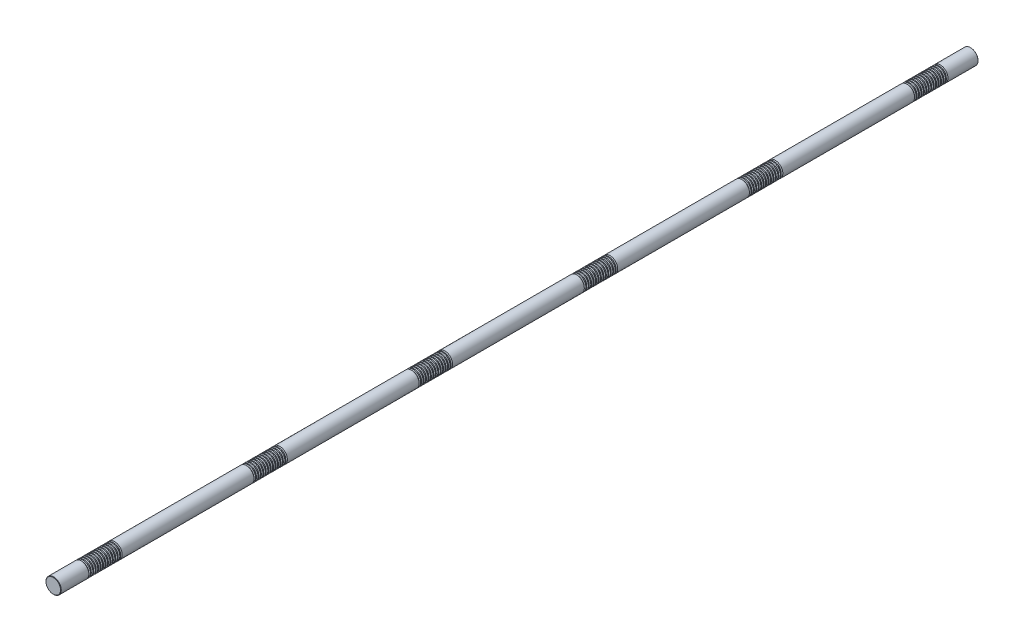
from build123d import *

# Parameters (mm, degrees)
SKETCH1_R           = 25
BOSS_EXTRUDE1_DEPTH = 1500
CHAMFER1_SIZE       = 1.25
LPATTERN1_COUNT     = 14
LPATTERN1_PITCH     = 8
LPATTERN2_COUNT     = 6
LPATTERN2_PITCH     = 540


with BuildPart() as part:
    # Sketch1 → Boss-Extrude1 (new, symmetric)
    with BuildSketch(Plane.XY):
        Circle(SKETCH1_R)
    extrude(amount=BOSS_EXTRUDE1_DEPTH, both=True)

    # Chamfer1
    chamfer1_edges = [part.edges().sort_by_distance(p)[0] for p in [
        (-25, 0, -1500),
        (-25, 0, 1500),
    ]]
    chamfer(chamfer1_edges, length=CHAMFER1_SIZE)

    # Sketch2 → Cut-Revolve1 (revolve, cut)
    with BuildSketch(Plane(origin=(0, 0, 0), x_dir=(0, 0, -1), z_dir=(1, 0, 0)), mode=Mode.PRIVATE) as cut_revolve1_sk:
        Polygon((1400.602885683, 25), (1395.397114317, 25), (1396.602885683, 20.5), (1399.397114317, 20.5), align=None)
    cut_revolve1 = revolve(cut_revolve1_sk.sketch.rotate(Axis((0, 0, 1500), (0, 0, -1)), 90), axis=Axis((0, 0, 1500), (0, 0, -1)), mode=Mode.SUBTRACT)

    # LPattern1: Cut-Revolve1 ×14
    with Locations(*[(0, 0, i * LPATTERN1_PITCH) for i in range(1, LPATTERN1_COUNT)]):
        add(cut_revolve1, mode=Mode.SUBTRACT)

    # LPattern2: Cut-Revolve1 ×6
    with Locations(*[(0, 0, i * LPATTERN2_PITCH) for i in range(1, LPATTERN2_COUNT)]):
        add(cut_revolve1, mode=Mode.SUBTRACT)

    # LPattern2 copy 1 sketch → LPattern2 copy 1 (revolve, cut)
    with BuildSketch(Plane(origin=(0, 0, 548), x_dir=(0, 0, -1), z_dir=(1, 0, 0))):
        Polygon((1400.602885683, 25), (1395.397114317, 25), (1396.602885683, 20.5), (1399.397114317, 20.5), align=None)
    revolve(axis=Axis((0, 0, 2048), (0, 0, -1)), mode=Mode.SUBTRACT)

    # LPattern2 copy 2 sketch → LPattern2 copy 2 (revolve, cut)
    with BuildSketch(Plane(origin=(0, 0, 1088), x_dir=(0, 0, -1), z_dir=(1, 0, 0))):
        Polygon((1400.602885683, 25), (1395.397114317, 25), (1396.602885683, 20.5), (1399.397114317, 20.5), align=None)
    revolve(axis=Axis((0, 0, 2588), (0, 0, -1)), mode=Mode.SUBTRACT)

    # LPattern2 copy 3 sketch → LPattern2 copy 3 (revolve, cut)
    with BuildSketch(Plane(origin=(0, 0, 1628), x_dir=(0, 0, -1), z_dir=(1, 0, 0))):
        Polygon((1400.602885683, 25), (1395.397114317, 25), (1396.602885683, 20.5), (1399.397114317, 20.5), align=None)
    revolve(axis=Axis((0, 0, 3128), (0, 0, -1)), mode=Mode.SUBTRACT)

    # LPattern2 copy 4 sketch → LPattern2 copy 4 (revolve, cut)
    with BuildSketch(Plane(origin=(0, 0, 2168), x_dir=(0, 0, -1), z_dir=(1, 0, 0))):
        Polygon((1400.602885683, 25), (1395.397114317, 25), (1396.602885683, 20.5), (1399.397114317, 20.5), align=None)
    revolve(axis=Axis((0, 0, 3668), (0, 0, -1)), mode=Mode.SUBTRACT)

    # LPattern2 copy 5 sketch → LPattern2 copy 5 (revolve, cut)
    with BuildSketch(Plane(origin=(0, 0, 2708), x_dir=(0, 0, -1), z_dir=(1, 0, 0))):
        Polygon((1400.602885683, 25), (1395.397114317, 25), (1396.602885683, 20.5), (1399.397114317, 20.5), align=None)
    revolve(axis=Axis((0, 0, 4208), (0, 0, -1)), mode=Mode.SUBTRACT)

    # LPattern2 copy 6 sketch → LPattern2 copy 6 (revolve, cut)
    with BuildSketch(Plane(origin=(0, 0, 556), x_dir=(0, 0, -1), z_dir=(1, 0, 0))):
        Polygon((1400.602885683, 25), (1395.397114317, 25), (1396.602885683, 20.5), (1399.397114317, 20.5), align=None)
    revolve(axis=Axis((0, 0, 2056), (0, 0, -1)), mode=Mode.SUBTRACT)

    # LPattern2 copy 7 sketch → LPattern2 copy 7 (revolve, cut)
    with BuildSketch(Plane(origin=(0, 0, 1096), x_dir=(0, 0, -1), z_dir=(1, 0, 0))):
        Polygon((1400.602885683, 25), (1395.397114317, 25), (1396.602885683, 20.5), (1399.397114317, 20.5), align=None)
    revolve(axis=Axis((0, 0, 2596), (0, 0, -1)), mode=Mode.SUBTRACT)

    # LPattern2 copy 8 sketch → LPattern2 copy 8 (revolve, cut)
    with BuildSketch(Plane(origin=(0, 0, 1636), x_dir=(0, 0, -1), z_dir=(1, 0, 0))):
        Polygon((1400.602885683, 25), (1395.397114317, 25), (1396.602885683, 20.5), (1399.397114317, 20.5), align=None)
    revolve(axis=Axis((0, 0, 3136), (0, 0, -1)), mode=Mode.SUBTRACT)

    # LPattern2 copy 9 sketch → LPattern2 copy 9 (revolve, cut)
    with BuildSketch(Plane(origin=(0, 0, 2176), x_dir=(0, 0, -1), z_dir=(1, 0, 0))):
        Polygon((1400.602885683, 25), (1395.397114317, 25), (1396.602885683, 20.5), (1399.397114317, 20.5), align=None)
    revolve(axis=Axis((0, 0, 3676), (0, 0, -1)), mode=Mode.SUBTRACT)

    # LPattern2 copy 10 sketch → LPattern2 copy 10 (revolve, cut)
    with BuildSketch(Plane(origin=(0, 0, 2716), x_dir=(0, 0, -1), z_dir=(1, 0, 0))):
        Polygon((1400.602885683, 25), (1395.397114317, 25), (1396.602885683, 20.5), (1399.397114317, 20.5), align=None)
    revolve(axis=Axis((0, 0, 4216), (0, 0, -1)), mode=Mode.SUBTRACT)

    # LPattern2 copy 11 sketch → LPattern2 copy 11 (revolve, cut)
    with BuildSketch(Plane(origin=(0, 0, 564), x_dir=(0, 0, -1), z_dir=(1, 0, 0))):
        Polygon((1400.602885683, 25), (1395.397114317, 25), (1396.602885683, 20.5), (1399.397114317, 20.5), align=None)
    revolve(axis=Axis((0, 0, 2064), (0, 0, -1)), mode=Mode.SUBTRACT)

    # LPattern2 copy 12 sketch → LPattern2 copy 12 (revolve, cut)
    with BuildSketch(Plane(origin=(0, 0, 1104), x_dir=(0, 0, -1), z_dir=(1, 0, 0))):
        Polygon((1400.602885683, 25), (1395.397114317, 25), (1396.602885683, 20.5), (1399.397114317, 20.5), align=None)
    revolve(axis=Axis((0, 0, 2604), (0, 0, -1)), mode=Mode.SUBTRACT)

    # LPattern2 copy 13 sketch → LPattern2 copy 13 (revolve, cut)
    with BuildSketch(Plane(origin=(0, 0, 1644), x_dir=(0, 0, -1), z_dir=(1, 0, 0))):
        Polygon((1400.602885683, 25), (1395.397114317, 25), (1396.602885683, 20.5), (1399.397114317, 20.5), align=None)
    revolve(axis=Axis((0, 0, 3144), (0, 0, -1)), mode=Mode.SUBTRACT)

    # LPattern2 copy 14 sketch → LPattern2 copy 14 (revolve, cut)
    with BuildSketch(Plane(origin=(0, 0, 2184), x_dir=(0, 0, -1), z_dir=(1, 0, 0))):
        Polygon((1400.602885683, 25), (1395.397114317, 25), (1396.602885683, 20.5), (1399.397114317, 20.5), align=None)
    revolve(axis=Axis((0, 0, 3684), (0, 0, -1)), mode=Mode.SUBTRACT)

    # LPattern2 copy 15 sketch → LPattern2 copy 15 (revolve, cut)
    with BuildSketch(Plane(origin=(0, 0, 2724), x_dir=(0, 0, -1), z_dir=(1, 0, 0))):
        Polygon((1400.602885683, 25), (1395.397114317, 25), (1396.602885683, 20.5), (1399.397114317, 20.5), align=None)
    revolve(axis=Axis((0, 0, 4224), (0, 0, -1)), mode=Mode.SUBTRACT)

    # LPattern2 copy 16 sketch → LPattern2 copy 16 (revolve, cut)
    with BuildSketch(Plane(origin=(0, 0, 572), x_dir=(0, 0, -1), z_dir=(1, 0, 0))):
        Polygon((1400.602885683, 25), (1395.397114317, 25), (1396.602885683, 20.5), (1399.397114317, 20.5), align=None)
    revolve(axis=Axis((0, 0, 2072), (0, 0, -1)), mode=Mode.SUBTRACT)

    # LPattern2 copy 17 sketch → LPattern2 copy 17 (revolve, cut)
    with BuildSketch(Plane(origin=(0, 0, 1112), x_dir=(0, 0, -1), z_dir=(1, 0, 0))):
        Polygon((1400.602885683, 25), (1395.397114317, 25), (1396.602885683, 20.5), (1399.397114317, 20.5), align=None)
    revolve(axis=Axis((0, 0, 2612), (0, 0, -1)), mode=Mode.SUBTRACT)

    # LPattern2 copy 18 sketch → LPattern2 copy 18 (revolve, cut)
    with BuildSketch(Plane(origin=(0, 0, 1652), x_dir=(0, 0, -1), z_dir=(1, 0, 0))):
        Polygon((1400.602885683, 25), (1395.397114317, 25), (1396.602885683, 20.5), (1399.397114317, 20.5), align=None)
    revolve(axis=Axis((0, 0, 3152), (0, 0, -1)), mode=Mode.SUBTRACT)

    # LPattern2 copy 19 sketch → LPattern2 copy 19 (revolve, cut)
    with BuildSketch(Plane(origin=(0, 0, 2192), x_dir=(0, 0, -1), z_dir=(1, 0, 0))):
        Polygon((1400.602885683, 25), (1395.397114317, 25), (1396.602885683, 20.5), (1399.397114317, 20.5), align=None)
    revolve(axis=Axis((0, 0, 3692), (0, 0, -1)), mode=Mode.SUBTRACT)

    # LPattern2 copy 20 sketch → LPattern2 copy 20 (revolve, cut)
    with BuildSketch(Plane(origin=(0, 0, 2732), x_dir=(0, 0, -1), z_dir=(1, 0, 0))):
        Polygon((1400.602885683, 25), (1395.397114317, 25), (1396.602885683, 20.5), (1399.397114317, 20.5), align=None)
    revolve(axis=Axis((0, 0, 4232), (0, 0, -1)), mode=Mode.SUBTRACT)

    # LPattern2 copy 21 sketch → LPattern2 copy 21 (revolve, cut)
    with BuildSketch(Plane(origin=(0, 0, 580), x_dir=(0, 0, -1), z_dir=(1, 0, 0))):
        Polygon((1400.602885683, 25), (1395.397114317, 25), (1396.602885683, 20.5), (1399.397114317, 20.5), align=None)
    revolve(axis=Axis((0, 0, 2080), (0, 0, -1)), mode=Mode.SUBTRACT)

    # LPattern2 copy 22 sketch → LPattern2 copy 22 (revolve, cut)
    with BuildSketch(Plane(origin=(0, 0, 1120), x_dir=(0, 0, -1), z_dir=(1, 0, 0))):
        Polygon((1400.602885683, 25), (1395.397114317, 25), (1396.602885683, 20.5), (1399.397114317, 20.5), align=None)
    revolve(axis=Axis((0, 0, 2620), (0, 0, -1)), mode=Mode.SUBTRACT)

    # LPattern2 copy 23 sketch → LPattern2 copy 23 (revolve, cut)
    with BuildSketch(Plane(origin=(0, 0, 1660), x_dir=(0, 0, -1), z_dir=(1, 0, 0))):
        Polygon((1400.602885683, 25), (1395.397114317, 25), (1396.602885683, 20.5), (1399.397114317, 20.5), align=None)
    revolve(axis=Axis((0, 0, 3160), (0, 0, -1)), mode=Mode.SUBTRACT)

    # LPattern2 copy 24 sketch → LPattern2 copy 24 (revolve, cut)
    with BuildSketch(Plane(origin=(0, 0, 2200), x_dir=(0, 0, -1), z_dir=(1, 0, 0))):
        Polygon((1400.602885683, 25), (1395.397114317, 25), (1396.602885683, 20.5), (1399.397114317, 20.5), align=None)
    revolve(axis=Axis((0, 0, 3700), (0, 0, -1)), mode=Mode.SUBTRACT)

    # LPattern2 copy 25 sketch → LPattern2 copy 25 (revolve, cut)
    with BuildSketch(Plane(origin=(0, 0, 2740), x_dir=(0, 0, -1), z_dir=(1, 0, 0))):
        Polygon((1400.602885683, 25), (1395.397114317, 25), (1396.602885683, 20.5), (1399.397114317, 20.5), align=None)
    revolve(axis=Axis((0, 0, 4240), (0, 0, -1)), mode=Mode.SUBTRACT)

    # LPattern2 copy 26 sketch → LPattern2 copy 26 (revolve, cut)
    with BuildSketch(Plane(origin=(0, 0, 588), x_dir=(0, 0, -1), z_dir=(1, 0, 0))):
        Polygon((1400.602885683, 25), (1395.397114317, 25), (1396.602885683, 20.5), (1399.397114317, 20.5), align=None)
    revolve(axis=Axis((0, 0, 2088), (0, 0, -1)), mode=Mode.SUBTRACT)

    # LPattern2 copy 27 sketch → LPattern2 copy 27 (revolve, cut)
    with BuildSketch(Plane(origin=(0, 0, 1128), x_dir=(0, 0, -1), z_dir=(1, 0, 0))):
        Polygon((1400.602885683, 25), (1395.397114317, 25), (1396.602885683, 20.5), (1399.397114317, 20.5), align=None)
    revolve(axis=Axis((0, 0, 2628), (0, 0, -1)), mode=Mode.SUBTRACT)

    # LPattern2 copy 28 sketch → LPattern2 copy 28 (revolve, cut)
    with BuildSketch(Plane(origin=(0, 0, 1668), x_dir=(0, 0, -1), z_dir=(1, 0, 0))):
        Polygon((1400.602885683, 25), (1395.397114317, 25), (1396.602885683, 20.5), (1399.397114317, 20.5), align=None)
    revolve(axis=Axis((0, 0, 3168), (0, 0, -1)), mode=Mode.SUBTRACT)

    # LPattern2 copy 29 sketch → LPattern2 copy 29 (revolve, cut)
    with BuildSketch(Plane(origin=(0, 0, 2208), x_dir=(0, 0, -1), z_dir=(1, 0, 0))):
        Polygon((1400.602885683, 25), (1395.397114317, 25), (1396.602885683, 20.5), (1399.397114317, 20.5), align=None)
    revolve(axis=Axis((0, 0, 3708), (0, 0, -1)), mode=Mode.SUBTRACT)

    # LPattern2 copy 30 sketch → LPattern2 copy 30 (revolve, cut)
    with BuildSketch(Plane(origin=(0, 0, 2748), x_dir=(0, 0, -1), z_dir=(1, 0, 0))):
        Polygon((1400.602885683, 25), (1395.397114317, 25), (1396.602885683, 20.5), (1399.397114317, 20.5), align=None)
    revolve(axis=Axis((0, 0, 4248), (0, 0, -1)), mode=Mode.SUBTRACT)

    # LPattern2 copy 31 sketch → LPattern2 copy 31 (revolve, cut)
    with BuildSketch(Plane(origin=(0, 0, 596), x_dir=(0, 0, -1), z_dir=(1, 0, 0))):
        Polygon((1400.602885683, 25), (1395.397114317, 25), (1396.602885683, 20.5), (1399.397114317, 20.5), align=None)
    revolve(axis=Axis((0, 0, 2096), (0, 0, -1)), mode=Mode.SUBTRACT)

    # LPattern2 copy 32 sketch → LPattern2 copy 32 (revolve, cut)
    with BuildSketch(Plane(origin=(0, 0, 1136), x_dir=(0, 0, -1), z_dir=(1, 0, 0))):
        Polygon((1400.602885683, 25), (1395.397114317, 25), (1396.602885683, 20.5), (1399.397114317, 20.5), align=None)
    revolve(axis=Axis((0, 0, 2636), (0, 0, -1)), mode=Mode.SUBTRACT)

    # LPattern2 copy 33 sketch → LPattern2 copy 33 (revolve, cut)
    with BuildSketch(Plane(origin=(0, 0, 1676), x_dir=(0, 0, -1), z_dir=(1, 0, 0))):
        Polygon((1400.602885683, 25), (1395.397114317, 25), (1396.602885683, 20.5), (1399.397114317, 20.5), align=None)
    revolve(axis=Axis((0, 0, 3176), (0, 0, -1)), mode=Mode.SUBTRACT)

    # LPattern2 copy 34 sketch → LPattern2 copy 34 (revolve, cut)
    with BuildSketch(Plane(origin=(0, 0, 2216), x_dir=(0, 0, -1), z_dir=(1, 0, 0))):
        Polygon((1400.602885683, 25), (1395.397114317, 25), (1396.602885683, 20.5), (1399.397114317, 20.5), align=None)
    revolve(axis=Axis((0, 0, 3716), (0, 0, -1)), mode=Mode.SUBTRACT)

    # LPattern2 copy 35 sketch → LPattern2 copy 35 (revolve, cut)
    with BuildSketch(Plane(origin=(0, 0, 2756), x_dir=(0, 0, -1), z_dir=(1, 0, 0))):
        Polygon((1400.602885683, 25), (1395.397114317, 25), (1396.602885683, 20.5), (1399.397114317, 20.5), align=None)
    revolve(axis=Axis((0, 0, 4256), (0, 0, -1)), mode=Mode.SUBTRACT)

    # LPattern2 copy 36 sketch → LPattern2 copy 36 (revolve, cut)
    with BuildSketch(Plane(origin=(0, 0, 604), x_dir=(0, 0, -1), z_dir=(1, 0, 0))):
        Polygon((1400.602885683, 25), (1395.397114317, 25), (1396.602885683, 20.5), (1399.397114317, 20.5), align=None)
    revolve(axis=Axis((0, 0, 2104), (0, 0, -1)), mode=Mode.SUBTRACT)

    # LPattern2 copy 37 sketch → LPattern2 copy 37 (revolve, cut)
    with BuildSketch(Plane(origin=(0, 0, 1144), x_dir=(0, 0, -1), z_dir=(1, 0, 0))):
        Polygon((1400.602885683, 25), (1395.397114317, 25), (1396.602885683, 20.5), (1399.397114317, 20.5), align=None)
    revolve(axis=Axis((0, 0, 2644), (0, 0, -1)), mode=Mode.SUBTRACT)

    # LPattern2 copy 38 sketch → LPattern2 copy 38 (revolve, cut)
    with BuildSketch(Plane(origin=(0, 0, 1684), x_dir=(0, 0, -1), z_dir=(1, 0, 0))):
        Polygon((1400.602885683, 25), (1395.397114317, 25), (1396.602885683, 20.5), (1399.397114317, 20.5), align=None)
    revolve(axis=Axis((0, 0, 3184), (0, 0, -1)), mode=Mode.SUBTRACT)

    # LPattern2 copy 39 sketch → LPattern2 copy 39 (revolve, cut)
    with BuildSketch(Plane(origin=(0, 0, 2224), x_dir=(0, 0, -1), z_dir=(1, 0, 0))):
        Polygon((1400.602885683, 25), (1395.397114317, 25), (1396.602885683, 20.5), (1399.397114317, 20.5), align=None)
    revolve(axis=Axis((0, 0, 3724), (0, 0, -1)), mode=Mode.SUBTRACT)

    # LPattern2 copy 40 sketch → LPattern2 copy 40 (revolve, cut)
    with BuildSketch(Plane(origin=(0, 0, 2764), x_dir=(0, 0, -1), z_dir=(1, 0, 0))):
        Polygon((1400.602885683, 25), (1395.397114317, 25), (1396.602885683, 20.5), (1399.397114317, 20.5), align=None)
    revolve(axis=Axis((0, 0, 4264), (0, 0, -1)), mode=Mode.SUBTRACT)

    # LPattern2 copy 41 sketch → LPattern2 copy 41 (revolve, cut)
    with BuildSketch(Plane(origin=(0, 0, 612), x_dir=(0, 0, -1), z_dir=(1, 0, 0))):
        Polygon((1400.602885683, 25), (1395.397114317, 25), (1396.602885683, 20.5), (1399.397114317, 20.5), align=None)
    revolve(axis=Axis((0, 0, 2112), (0, 0, -1)), mode=Mode.SUBTRACT)

    # LPattern2 copy 42 sketch → LPattern2 copy 42 (revolve, cut)
    with BuildSketch(Plane(origin=(0, 0, 1152), x_dir=(0, 0, -1), z_dir=(1, 0, 0))):
        Polygon((1400.602885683, 25), (1395.397114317, 25), (1396.602885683, 20.5), (1399.397114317, 20.5), align=None)
    revolve(axis=Axis((0, 0, 2652), (0, 0, -1)), mode=Mode.SUBTRACT)

    # LPattern2 copy 43 sketch → LPattern2 copy 43 (revolve, cut)
    with BuildSketch(Plane(origin=(0, 0, 1692), x_dir=(0, 0, -1), z_dir=(1, 0, 0))):
        Polygon((1400.602885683, 25), (1395.397114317, 25), (1396.602885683, 20.5), (1399.397114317, 20.5), align=None)
    revolve(axis=Axis((0, 0, 3192), (0, 0, -1)), mode=Mode.SUBTRACT)

    # LPattern2 copy 44 sketch → LPattern2 copy 44 (revolve, cut)
    with BuildSketch(Plane(origin=(0, 0, 2232), x_dir=(0, 0, -1), z_dir=(1, 0, 0))):
        Polygon((1400.602885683, 25), (1395.397114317, 25), (1396.602885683, 20.5), (1399.397114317, 20.5), align=None)
    revolve(axis=Axis((0, 0, 3732), (0, 0, -1)), mode=Mode.SUBTRACT)

    # LPattern2 copy 45 sketch → LPattern2 copy 45 (revolve, cut)
    with BuildSketch(Plane(origin=(0, 0, 2772), x_dir=(0, 0, -1), z_dir=(1, 0, 0))):
        Polygon((1400.602885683, 25), (1395.397114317, 25), (1396.602885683, 20.5), (1399.397114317, 20.5), align=None)
    revolve(axis=Axis((0, 0, 4272), (0, 0, -1)), mode=Mode.SUBTRACT)

    # LPattern2 copy 46 sketch → LPattern2 copy 46 (revolve, cut)
    with BuildSketch(Plane(origin=(0, 0, 620), x_dir=(0, 0, -1), z_dir=(1, 0, 0))):
        Polygon((1400.602885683, 25), (1395.397114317, 25), (1396.602885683, 20.5), (1399.397114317, 20.5), align=None)
    revolve(axis=Axis((0, 0, 2120), (0, 0, -1)), mode=Mode.SUBTRACT)

    # LPattern2 copy 47 sketch → LPattern2 copy 47 (revolve, cut)
    with BuildSketch(Plane(origin=(0, 0, 1160), x_dir=(0, 0, -1), z_dir=(1, 0, 0))):
        Polygon((1400.602885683, 25), (1395.397114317, 25), (1396.602885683, 20.5), (1399.397114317, 20.5), align=None)
    revolve(axis=Axis((0, 0, 2660), (0, 0, -1)), mode=Mode.SUBTRACT)

    # LPattern2 copy 48 sketch → LPattern2 copy 48 (revolve, cut)
    with BuildSketch(Plane(origin=(0, 0, 1700), x_dir=(0, 0, -1), z_dir=(1, 0, 0))):
        Polygon((1400.602885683, 25), (1395.397114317, 25), (1396.602885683, 20.5), (1399.397114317, 20.5), align=None)
    revolve(axis=Axis((0, 0, 3200), (0, 0, -1)), mode=Mode.SUBTRACT)

    # LPattern2 copy 49 sketch → LPattern2 copy 49 (revolve, cut)
    with BuildSketch(Plane(origin=(0, 0, 2240), x_dir=(0, 0, -1), z_dir=(1, 0, 0))):
        Polygon((1400.602885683, 25), (1395.397114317, 25), (1396.602885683, 20.5), (1399.397114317, 20.5), align=None)
    revolve(axis=Axis((0, 0, 3740), (0, 0, -1)), mode=Mode.SUBTRACT)

    # LPattern2 copy 50 sketch → LPattern2 copy 50 (revolve, cut)
    with BuildSketch(Plane(origin=(0, 0, 2780), x_dir=(0, 0, -1), z_dir=(1, 0, 0))):
        Polygon((1400.602885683, 25), (1395.397114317, 25), (1396.602885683, 20.5), (1399.397114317, 20.5), align=None)
    revolve(axis=Axis((0, 0, 4280), (0, 0, -1)), mode=Mode.SUBTRACT)

    # LPattern2 copy 51 sketch → LPattern2 copy 51 (revolve, cut)
    with BuildSketch(Plane(origin=(0, 0, 628), x_dir=(0, 0, -1), z_dir=(1, 0, 0))):
        Polygon((1400.602885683, 25), (1395.397114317, 25), (1396.602885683, 20.5), (1399.397114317, 20.5), align=None)
    revolve(axis=Axis((0, 0, 2128), (0, 0, -1)), mode=Mode.SUBTRACT)

    # LPattern2 copy 52 sketch → LPattern2 copy 52 (revolve, cut)
    with BuildSketch(Plane(origin=(0, 0, 1168), x_dir=(0, 0, -1), z_dir=(1, 0, 0))):
        Polygon((1400.602885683, 25), (1395.397114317, 25), (1396.602885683, 20.5), (1399.397114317, 20.5), align=None)
    revolve(axis=Axis((0, 0, 2668), (0, 0, -1)), mode=Mode.SUBTRACT)

    # LPattern2 copy 53 sketch → LPattern2 copy 53 (revolve, cut)
    with BuildSketch(Plane(origin=(0, 0, 1708), x_dir=(0, 0, -1), z_dir=(1, 0, 0))):
        Polygon((1400.602885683, 25), (1395.397114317, 25), (1396.602885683, 20.5), (1399.397114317, 20.5), align=None)
    revolve(axis=Axis((0, 0, 3208), (0, 0, -1)), mode=Mode.SUBTRACT)

    # LPattern2 copy 54 sketch → LPattern2 copy 54 (revolve, cut)
    with BuildSketch(Plane(origin=(0, 0, 2248), x_dir=(0, 0, -1), z_dir=(1, 0, 0))):
        Polygon((1400.602885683, 25), (1395.397114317, 25), (1396.602885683, 20.5), (1399.397114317, 20.5), align=None)
    revolve(axis=Axis((0, 0, 3748), (0, 0, -1)), mode=Mode.SUBTRACT)

    # LPattern2 copy 55 sketch → LPattern2 copy 55 (revolve, cut)
    with BuildSketch(Plane(origin=(0, 0, 2788), x_dir=(0, 0, -1), z_dir=(1, 0, 0))):
        Polygon((1400.602885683, 25), (1395.397114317, 25), (1396.602885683, 20.5), (1399.397114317, 20.5), align=None)
    revolve(axis=Axis((0, 0, 4288), (0, 0, -1)), mode=Mode.SUBTRACT)

    # LPattern2 copy 56 sketch → LPattern2 copy 56 (revolve, cut)
    with BuildSketch(Plane(origin=(0, 0, 636), x_dir=(0, 0, -1), z_dir=(1, 0, 0))):
        Polygon((1400.602885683, 25), (1395.397114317, 25), (1396.602885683, 20.5), (1399.397114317, 20.5), align=None)
    revolve(axis=Axis((0, 0, 2136), (0, 0, -1)), mode=Mode.SUBTRACT)

    # LPattern2 copy 57 sketch → LPattern2 copy 57 (revolve, cut)
    with BuildSketch(Plane(origin=(0, 0, 1176), x_dir=(0, 0, -1), z_dir=(1, 0, 0))):
        Polygon((1400.602885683, 25), (1395.397114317, 25), (1396.602885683, 20.5), (1399.397114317, 20.5), align=None)
    revolve(axis=Axis((0, 0, 2676), (0, 0, -1)), mode=Mode.SUBTRACT)

    # LPattern2 copy 58 sketch → LPattern2 copy 58 (revolve, cut)
    with BuildSketch(Plane(origin=(0, 0, 1716), x_dir=(0, 0, -1), z_dir=(1, 0, 0))):
        Polygon((1400.602885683, 25), (1395.397114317, 25), (1396.602885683, 20.5), (1399.397114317, 20.5), align=None)
    revolve(axis=Axis((0, 0, 3216), (0, 0, -1)), mode=Mode.SUBTRACT)

    # LPattern2 copy 59 sketch → LPattern2 copy 59 (revolve, cut)
    with BuildSketch(Plane(origin=(0, 0, 2256), x_dir=(0, 0, -1), z_dir=(1, 0, 0))):
        Polygon((1400.602885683, 25), (1395.397114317, 25), (1396.602885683, 20.5), (1399.397114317, 20.5), align=None)
    revolve(axis=Axis((0, 0, 3756), (0, 0, -1)), mode=Mode.SUBTRACT)

    # LPattern2 copy 60 sketch → LPattern2 copy 60 (revolve, cut)
    with BuildSketch(Plane(origin=(0, 0, 2796), x_dir=(0, 0, -1), z_dir=(1, 0, 0))):
        Polygon((1400.602885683, 25), (1395.397114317, 25), (1396.602885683, 20.5), (1399.397114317, 20.5), align=None)
    revolve(axis=Axis((0, 0, 4296), (0, 0, -1)), mode=Mode.SUBTRACT)

    # LPattern2 copy 61 sketch → LPattern2 copy 61 (revolve, cut)
    with BuildSketch(Plane(origin=(0, 0, 644), x_dir=(0, 0, -1), z_dir=(1, 0, 0))):
        Polygon((1400.602885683, 25), (1395.397114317, 25), (1396.602885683, 20.5), (1399.397114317, 20.5), align=None)
    revolve(axis=Axis((0, 0, 2144), (0, 0, -1)), mode=Mode.SUBTRACT)

    # LPattern2 copy 62 sketch → LPattern2 copy 62 (revolve, cut)
    with BuildSketch(Plane(origin=(0, 0, 1184), x_dir=(0, 0, -1), z_dir=(1, 0, 0))):
        Polygon((1400.602885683, 25), (1395.397114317, 25), (1396.602885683, 20.5), (1399.397114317, 20.5), align=None)
    revolve(axis=Axis((0, 0, 2684), (0, 0, -1)), mode=Mode.SUBTRACT)

    # LPattern2 copy 63 sketch → LPattern2 copy 63 (revolve, cut)
    with BuildSketch(Plane(origin=(0, 0, 1724), x_dir=(0, 0, -1), z_dir=(1, 0, 0))):
        Polygon((1400.602885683, 25), (1395.397114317, 25), (1396.602885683, 20.5), (1399.397114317, 20.5), align=None)
    revolve(axis=Axis((0, 0, 3224), (0, 0, -1)), mode=Mode.SUBTRACT)

    # LPattern2 copy 64 sketch → LPattern2 copy 64 (revolve, cut)
    with BuildSketch(Plane(origin=(0, 0, 2264), x_dir=(0, 0, -1), z_dir=(1, 0, 0))):
        Polygon((1400.602885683, 25), (1395.397114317, 25), (1396.602885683, 20.5), (1399.397114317, 20.5), align=None)
    revolve(axis=Axis((0, 0, 3764), (0, 0, -1)), mode=Mode.SUBTRACT)

    # LPattern2 copy 65 sketch → LPattern2 copy 65 (revolve, cut)
    with BuildSketch(Plane(origin=(0, 0, 2804), x_dir=(0, 0, -1), z_dir=(1, 0, 0))):
        Polygon((1400.602885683, 25), (1395.397114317, 25), (1396.602885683, 20.5), (1399.397114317, 20.5), align=None)
    revolve(axis=Axis((0, 0, 4304), (0, 0, -1)), mode=Mode.SUBTRACT)


solid = part.part
